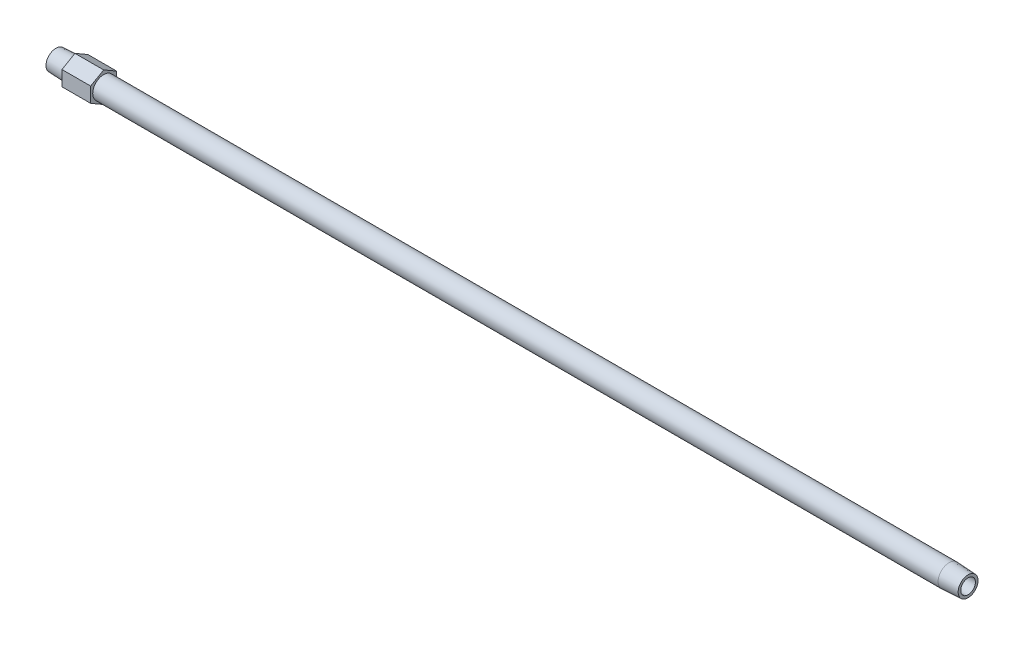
ISO-10303-21;
HEADER;
FILE_DESCRIPTION(('STEP AP214'),'2;1');
FILE_NAME('part.step','',(''),(''),'','','');
FILE_SCHEMA(('AUTOMOTIVE_DESIGN { 1 0 10303 214 1 1 1 1 }'));
ENDSEC;
DATA;
#1=APPLICATION_CONTEXT('core data for automotive mechanical design processes');
#2=APPLICATION_PROTOCOL_DEFINITION('international standard','automotive_design',2000,#1);
#3=PRODUCT_CONTEXT('',#1,'mechanical');
#4=PRODUCT('Part','Part','',(#3));
#5=PRODUCT_RELATED_PRODUCT_CATEGORY('part','',(#4));
#6=PRODUCT_DEFINITION_FORMATION('','',#4);
#7=PRODUCT_DEFINITION_CONTEXT('part definition',#1,'design');
#8=PRODUCT_DEFINITION('design','',#6,#7);
#9=PRODUCT_DEFINITION_SHAPE('','',#8);
#10=(LENGTH_UNIT() NAMED_UNIT(*) SI_UNIT(.MILLI.,.METRE.));
#11=(NAMED_UNIT(*) PLANE_ANGLE_UNIT() SI_UNIT($,.RADIAN.));
#12=(NAMED_UNIT(*) SI_UNIT($,.STERADIAN.) SOLID_ANGLE_UNIT());
#13=UNCERTAINTY_MEASURE_WITH_UNIT(LENGTH_MEASURE(1.E-05),#10,'distance_accuracy_value','');
#14=(GEOMETRIC_REPRESENTATION_CONTEXT(3) GLOBAL_UNCERTAINTY_ASSIGNED_CONTEXT((#13)) GLOBAL_UNIT_ASSIGNED_CONTEXT((#10,
#11,#12)) REPRESENTATION_CONTEXT('',''));
#15=CARTESIAN_POINT('',(0.,0.,0.));
#16=DIRECTION('',(0.,0.,1.));
#17=DIRECTION('',(1.,0.,0.));
#18=AXIS2_PLACEMENT_3D('',#15,#16,#17);
#19=CARTESIAN_POINT('',(0.,0.,-3.59899397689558));
#20=DIRECTION('',(1.,0.,0.));
#21=DIRECTION('',(0.,0.,-1.));
#22=AXIS2_PLACEMENT_3D('',#19,#20,#21);
#23=PLANE('',#22);
#24=CARTESIAN_POINT('',(0.,0.,0.));
#25=DIRECTION('',(-1.,0.,0.));
#26=DIRECTION('',(0.,0.,1.));
#27=AXIS2_PLACEMENT_3D('',#24,#25,#26);
#28=CIRCLE('',#27,3.59899397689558);
#29=CARTESIAN_POINT('',(0.,0.,3.59899397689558));
#30=VERTEX_POINT('',#29);
#31=EDGE_CURVE('E147',#30,#30,#28,.T.);
#32=ORIENTED_EDGE('',*,*,#31,.T.);
#33=EDGE_LOOP('',(#32));
#34=FACE_BOUND('',#33,.T.);
#35=CARTESIAN_POINT('',(0.,0.,0.));
#36=DIRECTION('',(1.,0.,0.));
#37=DIRECTION('',(0.,0.,1.));
#38=AXIS2_PLACEMENT_3D('',#35,#36,#37);
#39=CIRCLE('',#38,2.6543);
#40=CARTESIAN_POINT('',(0.,0.,2.6543));
#41=VERTEX_POINT('',#40);
#42=EDGE_CURVE('E159',#41,#41,#39,.T.);
#43=ORIENTED_EDGE('',*,*,#42,.T.);
#44=EDGE_LOOP('',(#43));
#45=FACE_BOUND('',#44,.T.);
#46=ADVANCED_FACE('F15',(#34,#45),#23,.F.);
#47=CARTESIAN_POINT('',(330.2,0.,-3.59899397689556));
#48=DIRECTION('',(-1.,0.,0.));
#49=DIRECTION('',(0.,0.,1.));
#50=AXIS2_PLACEMENT_3D('',#47,#48,#49);
#51=PLANE('',#50);
#52=CARTESIAN_POINT('',(330.2,0.,0.));
#53=DIRECTION('',(-1.,0.,0.));
#54=DIRECTION('',(0.,0.,1.));
#55=AXIS2_PLACEMENT_3D('',#52,#53,#54);
#56=CIRCLE('',#55,3.59899397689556);
#57=CARTESIAN_POINT('',(330.2,0.,3.59899397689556));
#58=VERTEX_POINT('',#57);
#59=EDGE_CURVE('E150',#58,#58,#56,.T.);
#60=ORIENTED_EDGE('',*,*,#59,.F.);
#61=EDGE_LOOP('',(#60));
#62=FACE_BOUND('',#61,.T.);
#63=CARTESIAN_POINT('',(330.2,0.,0.));
#64=DIRECTION('',(-1.,0.,0.));
#65=DIRECTION('',(0.,0.,1.));
#66=AXIS2_PLACEMENT_3D('',#63,#64,#65);
#67=CIRCLE('',#66,2.6543);
#68=CARTESIAN_POINT('',(330.2,0.,2.6543));
#69=VERTEX_POINT('',#68);
#70=EDGE_CURVE('E156',#69,#69,#67,.F.);
#71=ORIENTED_EDGE('',*,*,#70,.F.);
#72=EDGE_LOOP('',(#71));
#73=FACE_BOUND('',#72,.T.);
#74=ADVANCED_FACE('F178',(#62,#73),#51,.F.);
#75=CARTESIAN_POINT('',(17.272,-2.71296891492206,-4.699));
#76=DIRECTION('',(1.,0.,0.));
#77=DIRECTION('',(0.,1.,0.));
#78=AXIS2_PLACEMENT_3D('',#75,#76,#77);
#79=PLANE('',#78);
#80=DIRECTION('',(0.,0.5,-0.866025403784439));
#81=VECTOR('',#80,1.);
#82=CARTESIAN_POINT('',(17.272,-5.4259378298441,0.));
#83=LINE('',#82,#81);
#84=CARTESIAN_POINT('',(17.272,-5.4259378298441,0.));
#85=VERTEX_POINT('',#84);
#86=CARTESIAN_POINT('',(17.272,-2.71296891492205,-4.699));
#87=VERTEX_POINT('',#86);
#88=EDGE_CURVE('E103',#85,#87,#83,.T.);
#89=ORIENTED_EDGE('',*,*,#88,.T.);
#90=DIRECTION('',(0.,1.,0.));
#91=VECTOR('',#90,1.);
#92=CARTESIAN_POINT('',(17.272,-2.71296891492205,-4.699));
#93=LINE('',#92,#91);
#94=CARTESIAN_POINT('',(17.272,2.71296891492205,-4.699));
#95=VERTEX_POINT('',#94);
#96=EDGE_CURVE('E83',#87,#95,#93,.T.);
#97=ORIENTED_EDGE('',*,*,#96,.T.);
#98=DIRECTION('',(0.,0.5,0.866025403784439));
#99=VECTOR('',#98,1.);
#100=CARTESIAN_POINT('',(17.272,2.71296891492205,-4.699));
#101=LINE('',#100,#99);
#102=CARTESIAN_POINT('',(17.272,5.4259378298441,0.));
#103=VERTEX_POINT('',#102);
#104=EDGE_CURVE('E102',#95,#103,#101,.T.);
#105=ORIENTED_EDGE('',*,*,#104,.T.);
#106=DIRECTION('',(0.,-0.5,0.866025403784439));
#107=VECTOR('',#106,1.);
#108=CARTESIAN_POINT('',(17.272,5.4259378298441,0.));
#109=LINE('',#108,#107);
#110=CARTESIAN_POINT('',(17.272,2.71296891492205,4.699));
#111=VERTEX_POINT('',#110);
#112=EDGE_CURVE('E105',#103,#111,#109,.T.);
#113=ORIENTED_EDGE('',*,*,#112,.T.);
#114=DIRECTION('',(0.,-1.,0.));
#115=VECTOR('',#114,1.);
#116=CARTESIAN_POINT('',(17.272,2.71296891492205,4.699));
#117=LINE('',#116,#115);
#118=CARTESIAN_POINT('',(17.272,-2.71296891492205,4.699));
#119=VERTEX_POINT('',#118);
#120=EDGE_CURVE('E35',#111,#119,#117,.T.);
#121=ORIENTED_EDGE('',*,*,#120,.T.);
#122=DIRECTION('',(0.,-0.5,-0.866025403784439));
#123=VECTOR('',#122,1.);
#124=CARTESIAN_POINT('',(17.272,-2.71296891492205,4.699));
#125=LINE('',#124,#123);
#126=EDGE_CURVE('E30',#119,#85,#125,.T.);
#127=ORIENTED_EDGE('',*,*,#126,.T.);
#128=EDGE_LOOP('',(#89,#97,#105,#113,#121,#127));
#129=FACE_BOUND('',#128,.T.);
#130=CARTESIAN_POINT('',(17.272,0.,0.));
#131=DIRECTION('',(1.,0.,0.));
#132=DIRECTION('',(0.,1.,0.));
#133=AXIS2_PLACEMENT_3D('',#130,#131,#132);
#134=CIRCLE('',#133,3.95973768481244);
#135=CARTESIAN_POINT('',(17.272,3.95973768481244,0.));
#136=VERTEX_POINT('',#135);
#137=EDGE_CURVE('E89',#136,#136,#134,.F.);
#138=ORIENTED_EDGE('',*,*,#137,.T.);
#139=EDGE_LOOP('',(#138));
#140=FACE_BOUND('',#139,.T.);
#141=ADVANCED_FACE('F124',(#129,#140),#79,.T.);
#142=CARTESIAN_POINT('',(6.8834,-2.71296891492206,-4.699));
#143=DIRECTION('',(1.,0.,0.));
#144=DIRECTION('',(0.,1.,0.));
#145=AXIS2_PLACEMENT_3D('',#142,#143,#144);
#146=PLANE('',#145);
#147=DIRECTION('',(0.,0.5,-0.866025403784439));
#148=VECTOR('',#147,1.);
#149=CARTESIAN_POINT('',(6.8834,-5.4259378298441,0.));
#150=LINE('',#149,#148);
#151=CARTESIAN_POINT('',(6.8834,-5.4259378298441,0.));
#152=VERTEX_POINT('',#151);
#153=CARTESIAN_POINT('',(6.8834,-2.71296891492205,-4.699));
#154=VERTEX_POINT('',#153);
#155=EDGE_CURVE('E73',#152,#154,#150,.T.);
#156=ORIENTED_EDGE('',*,*,#155,.F.);
#157=DIRECTION('',(0.,-0.5,-0.866025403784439));
#158=VECTOR('',#157,1.);
#159=CARTESIAN_POINT('',(6.8834,-2.71296891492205,4.699));
#160=LINE('',#159,#158);
#161=CARTESIAN_POINT('',(6.8834,-2.71296891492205,4.699));
#162=VERTEX_POINT('',#161);
#163=EDGE_CURVE('E99',#162,#152,#160,.T.);
#164=ORIENTED_EDGE('',*,*,#163,.F.);
#165=DIRECTION('',(0.,-1.,0.));
#166=VECTOR('',#165,1.);
#167=CARTESIAN_POINT('',(6.8834,2.71296891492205,4.699));
#168=LINE('',#167,#166);
#169=CARTESIAN_POINT('',(6.8834,2.71296891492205,4.699));
#170=VERTEX_POINT('',#169);
#171=EDGE_CURVE('E133',#170,#162,#168,.T.);
#172=ORIENTED_EDGE('',*,*,#171,.F.);
#173=DIRECTION('',(0.,-0.5,0.866025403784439));
#174=VECTOR('',#173,1.);
#175=CARTESIAN_POINT('',(6.8834,5.4259378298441,0.));
#176=LINE('',#175,#174);
#177=CARTESIAN_POINT('',(6.8834,5.4259378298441,0.));
#178=VERTEX_POINT('',#177);
#179=EDGE_CURVE('E129',#178,#170,#176,.T.);
#180=ORIENTED_EDGE('',*,*,#179,.F.);
#181=DIRECTION('',(0.,0.5,0.866025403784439));
#182=VECTOR('',#181,1.);
#183=CARTESIAN_POINT('',(6.8834,2.71296891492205,-4.699));
#184=LINE('',#183,#182);
#185=CARTESIAN_POINT('',(6.8834,2.71296891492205,-4.699));
#186=VERTEX_POINT('',#185);
#187=EDGE_CURVE('E75',#186,#178,#184,.T.);
#188=ORIENTED_EDGE('',*,*,#187,.F.);
#189=DIRECTION('',(0.,1.,0.));
#190=VECTOR('',#189,1.);
#191=CARTESIAN_POINT('',(6.8834,-2.71296891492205,-4.699));
#192=LINE('',#191,#190);
#193=EDGE_CURVE('E68',#154,#186,#192,.T.);
#194=ORIENTED_EDGE('',*,*,#193,.F.);
#195=EDGE_LOOP('',(#156,#164,#172,#180,#188,#194));
#196=FACE_BOUND('',#195,.T.);
#197=CARTESIAN_POINT('',(6.8834,0.,0.));
#198=DIRECTION('',(-1.,0.,0.));
#199=DIRECTION('',(0.,0.,1.));
#200=AXIS2_PLACEMENT_3D('',#197,#198,#199);
#201=CIRCLE('',#200,3.95973768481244);
#202=CARTESIAN_POINT('',(6.8834,0.,3.95973768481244));
#203=VERTEX_POINT('',#202);
#204=EDGE_CURVE('E95',#203,#203,#201,.T.);
#205=ORIENTED_EDGE('',*,*,#204,.F.);
#206=EDGE_LOOP('',(#205));
#207=FACE_BOUND('',#206,.T.);
#208=ADVANCED_FACE('F69',(#196,#207),#146,.F.);
#209=CARTESIAN_POINT('',(17.272,-5.4259378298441,0.));
#210=DIRECTION('',(0.,0.866025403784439,0.5));
#211=DIRECTION('',(0.,-0.5,0.866025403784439));
#212=AXIS2_PLACEMENT_3D('',#209,#210,#211);
#213=PLANE('',#212);
#214=ORIENTED_EDGE('',*,*,#155,.T.);
#215=DIRECTION('',(-1.,0.,0.));
#216=VECTOR('',#215,1.);
#217=CARTESIAN_POINT('',(17.272,-2.71296891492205,-4.699));
#218=LINE('',#217,#216);
#219=EDGE_CURVE('E10',#87,#154,#218,.T.);
#220=ORIENTED_EDGE('',*,*,#219,.F.);
#221=ORIENTED_EDGE('',*,*,#88,.F.);
#222=DIRECTION('',(-1.,0.,0.));
#223=VECTOR('',#222,1.);
#224=CARTESIAN_POINT('',(17.272,-5.4259378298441,0.));
#225=LINE('',#224,#223);
#226=EDGE_CURVE('E87',#85,#152,#225,.T.);
#227=ORIENTED_EDGE('',*,*,#226,.T.);
#228=EDGE_LOOP('',(#214,#220,#221,#227));
#229=FACE_BOUND('',#228,.T.);
#230=ADVANCED_FACE('F17',(#229),#213,.F.);
#231=CARTESIAN_POINT('',(17.272,-2.71296891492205,-4.699));
#232=DIRECTION('',(0.,0.,1.));
#233=DIRECTION('',(1.,0.,0.));
#234=AXIS2_PLACEMENT_3D('',#231,#232,#233);
#235=PLANE('',#234);
#236=ORIENTED_EDGE('',*,*,#193,.T.);
#237=DIRECTION('',(-1.,0.,0.));
#238=VECTOR('',#237,1.);
#239=CARTESIAN_POINT('',(17.272,2.71296891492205,-4.699));
#240=LINE('',#239,#238);
#241=EDGE_CURVE('E23',#95,#186,#240,.T.);
#242=ORIENTED_EDGE('',*,*,#241,.F.);
#243=ORIENTED_EDGE('',*,*,#96,.F.);
#244=ORIENTED_EDGE('',*,*,#219,.T.);
#245=EDGE_LOOP('',(#236,#242,#243,#244));
#246=FACE_BOUND('',#245,.T.);
#247=ADVANCED_FACE('F82',(#246),#235,.F.);
#248=CARTESIAN_POINT('',(17.272,2.71296891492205,-4.699));
#249=DIRECTION('',(0.,-0.866025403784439,0.5));
#250=DIRECTION('',(0.,-0.5,-0.866025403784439));
#251=AXIS2_PLACEMENT_3D('',#248,#249,#250);
#252=PLANE('',#251);
#253=ORIENTED_EDGE('',*,*,#187,.T.);
#254=DIRECTION('',(-1.,0.,0.));
#255=VECTOR('',#254,1.);
#256=CARTESIAN_POINT('',(17.272,5.4259378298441,0.));
#257=LINE('',#256,#255);
#258=EDGE_CURVE('E117',#103,#178,#257,.T.);
#259=ORIENTED_EDGE('',*,*,#258,.F.);
#260=ORIENTED_EDGE('',*,*,#104,.F.);
#261=ORIENTED_EDGE('',*,*,#241,.T.);
#262=EDGE_LOOP('',(#253,#259,#260,#261));
#263=FACE_BOUND('',#262,.T.);
#264=ADVANCED_FACE('F121',(#263),#252,.F.);
#265=CARTESIAN_POINT('',(17.272,5.4259378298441,0.));
#266=DIRECTION('',(0.,-0.866025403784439,-0.5));
#267=DIRECTION('',(0.,0.5,-0.866025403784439));
#268=AXIS2_PLACEMENT_3D('',#265,#266,#267);
#269=PLANE('',#268);
#270=ORIENTED_EDGE('',*,*,#179,.T.);
#271=DIRECTION('',(-1.,0.,0.));
#272=VECTOR('',#271,1.);
#273=CARTESIAN_POINT('',(17.272,2.71296891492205,4.699));
#274=LINE('',#273,#272);
#275=EDGE_CURVE('E114',#111,#170,#274,.T.);
#276=ORIENTED_EDGE('',*,*,#275,.F.);
#277=ORIENTED_EDGE('',*,*,#112,.F.);
#278=ORIENTED_EDGE('',*,*,#258,.T.);
#279=EDGE_LOOP('',(#270,#276,#277,#278));
#280=FACE_BOUND('',#279,.T.);
#281=ADVANCED_FACE('F128',(#280),#269,.F.);
#282=CARTESIAN_POINT('',(17.272,2.71296891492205,4.699));
#283=DIRECTION('',(0.,0.,-1.));
#284=DIRECTION('',(-1.,0.,0.));
#285=AXIS2_PLACEMENT_3D('',#282,#283,#284);
#286=PLANE('',#285);
#287=ORIENTED_EDGE('',*,*,#171,.T.);
#288=DIRECTION('',(-1.,0.,0.));
#289=VECTOR('',#288,1.);
#290=CARTESIAN_POINT('',(17.272,-2.71296891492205,4.699));
#291=LINE('',#290,#289);
#292=EDGE_CURVE('E111',#119,#162,#291,.T.);
#293=ORIENTED_EDGE('',*,*,#292,.F.);
#294=ORIENTED_EDGE('',*,*,#120,.F.);
#295=ORIENTED_EDGE('',*,*,#275,.T.);
#296=EDGE_LOOP('',(#287,#293,#294,#295));
#297=FACE_BOUND('',#296,.T.);
#298=ADVANCED_FACE('F132',(#297),#286,.F.);
#299=CARTESIAN_POINT('',(17.272,-2.71296891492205,4.699));
#300=DIRECTION('',(0.,0.866025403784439,-0.5));
#301=DIRECTION('',(0.,0.5,0.866025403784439));
#302=AXIS2_PLACEMENT_3D('',#299,#300,#301);
#303=PLANE('',#302);
#304=ORIENTED_EDGE('',*,*,#163,.T.);
#305=ORIENTED_EDGE('',*,*,#226,.F.);
#306=ORIENTED_EDGE('',*,*,#126,.F.);
#307=ORIENTED_EDGE('',*,*,#292,.T.);
#308=EDGE_LOOP('',(#304,#305,#306,#307));
#309=FACE_BOUND('',#308,.T.);
#310=ADVANCED_FACE('F135',(#309),#303,.F.);
#311=CARTESIAN_POINT('',(6.8834,0.,0.));
#312=DIRECTION('',(1.,0.,0.));
#313=DIRECTION('',(0.,0.,-1.));
#314=AXIS2_PLACEMENT_3D('',#311,#312,#313);
#315=CONICAL_SURFACE('',#314,3.95973768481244,0.0523598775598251);
#316=ORIENTED_EDGE('',*,*,#31,.F.);
#317=EDGE_LOOP('',(#316));
#318=FACE_BOUND('',#317,.T.);
#319=ORIENTED_EDGE('',*,*,#204,.T.);
#320=EDGE_LOOP('',(#319));
#321=FACE_BOUND('',#320,.T.);
#322=ADVANCED_FACE('F187',(#318,#321),#315,.T.);
#323=CARTESIAN_POINT('',(-60.,0.,0.));
#324=DIRECTION('',(-1.,0.,0.));
#325=DIRECTION('',(0.,0.,1.));
#326=AXIS2_PLACEMENT_3D('',#323,#324,#325);
#327=CYLINDRICAL_SURFACE('',#326,3.95973768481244);
#328=ORIENTED_EDGE('',*,*,#137,.F.);
#329=EDGE_LOOP('',(#328));
#330=FACE_BOUND('',#329,.T.);
#331=CARTESIAN_POINT('',(323.3166,0.,0.));
#332=DIRECTION('',(-1.,0.,0.));
#333=DIRECTION('',(0.,0.,1.));
#334=AXIS2_PLACEMENT_3D('',#331,#332,#333);
#335=CIRCLE('',#334,3.95973768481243);
#336=CARTESIAN_POINT('',(323.3166,0.,3.95973768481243));
#337=VERTEX_POINT('',#336);
#338=EDGE_CURVE('E153',#337,#337,#335,.T.);
#339=ORIENTED_EDGE('',*,*,#338,.T.);
#340=EDGE_LOOP('',(#339));
#341=FACE_BOUND('',#340,.T.);
#342=ADVANCED_FACE('F174',(#330,#341),#327,.T.);
#343=CARTESIAN_POINT('',(330.2,0.,0.));
#344=DIRECTION('',(-1.,0.,0.));
#345=DIRECTION('',(0.,0.,1.));
#346=AXIS2_PLACEMENT_3D('',#343,#344,#345);
#347=CONICAL_SURFACE('',#346,3.59899397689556,0.052359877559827);
#348=ORIENTED_EDGE('',*,*,#338,.F.);
#349=EDGE_LOOP('',(#348));
#350=FACE_BOUND('',#349,.T.);
#351=ORIENTED_EDGE('',*,*,#59,.T.);
#352=EDGE_LOOP('',(#351));
#353=FACE_BOUND('',#352,.T.);
#354=ADVANCED_FACE('F167',(#350,#353),#347,.T.);
#355=CARTESIAN_POINT('',(330.511914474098,0.,0.));
#356=DIRECTION('',(-1.,0.,0.));
#357=DIRECTION('',(0.,0.,1.));
#358=AXIS2_PLACEMENT_3D('',#355,#356,#357);
#359=CYLINDRICAL_SURFACE('',#358,2.6543);
#360=ORIENTED_EDGE('',*,*,#70,.T.);
#361=EDGE_LOOP('',(#360));
#362=FACE_BOUND('',#361,.T.);
#363=ORIENTED_EDGE('',*,*,#42,.F.);
#364=EDGE_LOOP('',(#363));
#365=FACE_BOUND('',#364,.T.);
#366=ADVANCED_FACE('F165',(#362,#365),#359,.F.);
#367=CLOSED_SHELL('',(#46,#74,#141,#208,#230,#247,#264,#281,#298,#310,#322,#342,#354,#366));
#368=MANIFOLD_SOLID_BREP('B1',#367);
#369=ADVANCED_BREP_SHAPE_REPRESENTATION('',(#18,#368),#14);
#370=SHAPE_DEFINITION_REPRESENTATION(#9,#369);
ENDSEC;
END-ISO-10303-21;
